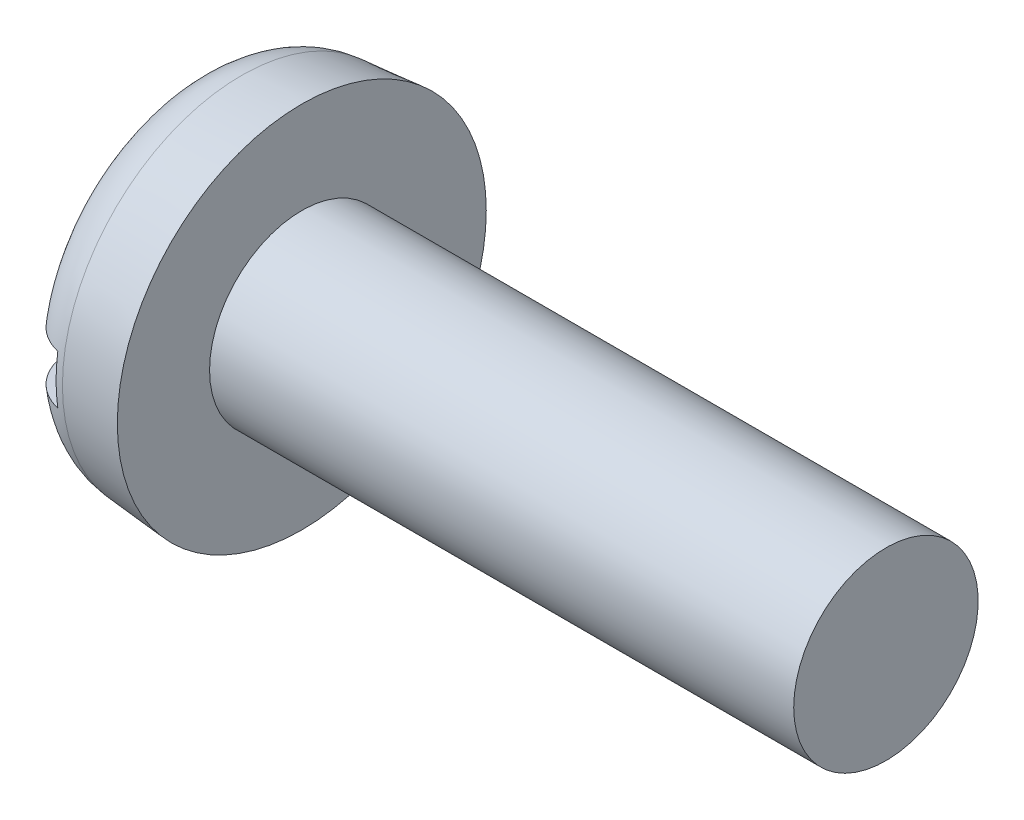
ISO-10303-21;
HEADER;
FILE_DESCRIPTION(('STEP AP214'),'2;1');
FILE_NAME('part.step','',(''),(''),'','','');
FILE_SCHEMA(('AUTOMOTIVE_DESIGN { 1 0 10303 214 1 1 1 1 }'));
ENDSEC;
DATA;
#1=APPLICATION_CONTEXT('core data for automotive mechanical design processes');
#2=APPLICATION_PROTOCOL_DEFINITION('international standard','automotive_design',2000,#1);
#3=PRODUCT_CONTEXT('',#1,'mechanical');
#4=PRODUCT('Part','Part','',(#3));
#5=PRODUCT_RELATED_PRODUCT_CATEGORY('part','',(#4));
#6=PRODUCT_DEFINITION_FORMATION('','',#4);
#7=PRODUCT_DEFINITION_CONTEXT('part definition',#1,'design');
#8=PRODUCT_DEFINITION('design','',#6,#7);
#9=PRODUCT_DEFINITION_SHAPE('','',#8);
#10=(LENGTH_UNIT() NAMED_UNIT(*) SI_UNIT(.MILLI.,.METRE.));
#11=(NAMED_UNIT(*) PLANE_ANGLE_UNIT() SI_UNIT($,.RADIAN.));
#12=(NAMED_UNIT(*) SI_UNIT($,.STERADIAN.) SOLID_ANGLE_UNIT());
#13=UNCERTAINTY_MEASURE_WITH_UNIT(LENGTH_MEASURE(1.E-05),#10,'distance_accuracy_value','');
#14=(GEOMETRIC_REPRESENTATION_CONTEXT(3) GLOBAL_UNCERTAINTY_ASSIGNED_CONTEXT((#13)) GLOBAL_UNIT_ASSIGNED_CONTEXT((#10,
#11,#12)) REPRESENTATION_CONTEXT('',''));
#15=CARTESIAN_POINT('',(0.,0.,0.));
#16=DIRECTION('',(0.,0.,1.));
#17=DIRECTION('',(1.,0.,0.));
#18=AXIS2_PLACEMENT_3D('',#15,#16,#17);
#19=CARTESIAN_POINT('',(0.,0.,0.));
#20=DIRECTION('',(-1.,0.,0.));
#21=DIRECTION('',(0.,0.,1.));
#22=AXIS2_PLACEMENT_3D('',#19,#20,#21);
#23=PLANE('',#22);
#24=DIRECTION('',(0.,0.,-1.));
#25=VECTOR('',#24,1.);
#26=CARTESIAN_POINT('',(0.,0.799999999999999,6.));
#27=LINE('',#26,#25);
#28=CARTESIAN_POINT('',(0.,0.799999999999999,3.9555566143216));
#29=VERTEX_POINT('',#28);
#30=CARTESIAN_POINT('',(0.,0.799999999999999,-3.9555566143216));
#31=VERTEX_POINT('',#30);
#32=EDGE_CURVE('E85',#29,#31,#27,.T.);
#33=ORIENTED_EDGE('',*,*,#32,.F.);
#34=CARTESIAN_POINT('',(0.,0.,0.));
#35=DIRECTION('',(-1.,0.,0.));
#36=DIRECTION('',(0.,0.,1.));
#37=AXIS2_PLACEMENT_3D('',#34,#35,#36);
#38=CIRCLE('',#37,4.03564469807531);
#39=EDGE_CURVE('E91',#29,#31,#38,.T.);
#40=ORIENTED_EDGE('',*,*,#39,.T.);
#41=EDGE_LOOP('',(#33,#40));
#42=FACE_BOUND('',#41,.T.);
#43=ADVANCED_FACE('F32',(#42),#23,.T.);
#44=CARTESIAN_POINT('',(-25.4,0.,0.));
#45=DIRECTION('',(-1.,0.,0.));
#46=DIRECTION('',(0.,0.,1.));
#47=AXIS2_PLACEMENT_3D('',#44,#45,#46);
#48=CYLINDRICAL_SURFACE('',#47,3.);
#49=CARTESIAN_POINT('',(22.6,0.,0.));
#50=DIRECTION('',(-1.,0.,0.));
#51=DIRECTION('',(0.,0.,1.));
#52=AXIS2_PLACEMENT_3D('',#49,#50,#51);
#53=CIRCLE('',#52,3.);
#54=CARTESIAN_POINT('',(22.6,0.,3.));
#55=VERTEX_POINT('',#54);
#56=EDGE_CURVE('E92',#55,#55,#53,.T.);
#57=ORIENTED_EDGE('',*,*,#56,.T.);
#58=EDGE_LOOP('',(#57));
#59=FACE_BOUND('',#58,.T.);
#60=CARTESIAN_POINT('',(3.6,0.,0.));
#61=DIRECTION('',(-1.,0.,0.));
#62=DIRECTION('',(0.,0.,1.));
#63=AXIS2_PLACEMENT_3D('',#60,#61,#62);
#64=CIRCLE('',#63,3.);
#65=CARTESIAN_POINT('',(3.6,0.,3.));
#66=VERTEX_POINT('',#65);
#67=EDGE_CURVE('E149',#66,#66,#64,.T.);
#68=ORIENTED_EDGE('',*,*,#67,.F.);
#69=EDGE_LOOP('',(#68));
#70=FACE_BOUND('',#69,.T.);
#71=ADVANCED_FACE('F137',(#59,#70),#48,.T.);
#72=CARTESIAN_POINT('',(22.6,3.,0.));
#73=DIRECTION('',(1.,0.,0.));
#74=DIRECTION('',(0.,0.,-1.));
#75=AXIS2_PLACEMENT_3D('',#72,#73,#74);
#76=PLANE('',#75);
#77=ORIENTED_EDGE('',*,*,#56,.F.);
#78=EDGE_LOOP('',(#77));
#79=FACE_BOUND('',#78,.T.);
#80=ADVANCED_FACE('F135',(#79),#76,.T.);
#81=DIRECTION('',(0.,0.,1.));
#82=VECTOR('',#81,1.);
#83=CARTESIAN_POINT('',(0.,-0.799999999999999,-6.));
#84=LINE('',#83,#82);
#85=CARTESIAN_POINT('',(0.,-0.799999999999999,-3.9555566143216));
#86=VERTEX_POINT('',#85);
#87=CARTESIAN_POINT('',(0.,-0.800000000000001,3.9555566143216));
#88=VERTEX_POINT('',#87);
#89=EDGE_CURVE('E76',#86,#88,#84,.T.);
#90=ORIENTED_EDGE('',*,*,#89,.F.);
#91=EDGE_CURVE('E83',#86,#88,#38,.T.);
#92=ORIENTED_EDGE('',*,*,#91,.T.);
#93=EDGE_LOOP('',(#90,#92));
#94=FACE_BOUND('',#93,.T.);
#95=ADVANCED_FACE('F82',(#94),#23,.T.);
#96=CARTESIAN_POINT('',(0.,0.,0.));
#97=DIRECTION('',(1.,0.,0.));
#98=DIRECTION('',(0.,0.,-1.));
#99=AXIS2_PLACEMENT_3D('',#96,#97,#98);
#100=CONICAL_SURFACE('',#99,5.68504081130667,0.0872664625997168);
#101=CARTESIAN_POINT('',(1.64311966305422,0.,0.));
#102=DIRECTION('',(-1.,0.,0.));
#103=DIRECTION('',(0.,0.,1.));
#104=AXIS2_PLACEMENT_3D('',#101,#102,#103);
#105=CIRCLE('',#104,5.82879515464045);
#106=CARTESIAN_POINT('',(1.64311966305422,0.,5.82879515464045));
#107=VERTEX_POINT('',#106);
#108=EDGE_CURVE('E95',#107,#107,#105,.F.);
#109=ORIENTED_EDGE('',*,*,#108,.T.);
#110=EDGE_LOOP('',(#109));
#111=FACE_BOUND('',#110,.T.);
#112=CARTESIAN_POINT('',(3.6,0.,0.));
#113=DIRECTION('',(-1.,0.,0.));
#114=DIRECTION('',(0.,0.,1.));
#115=AXIS2_PLACEMENT_3D('',#112,#113,#114);
#116=CIRCLE('',#115,6.);
#117=CARTESIAN_POINT('',(3.6,0.,6.));
#118=VERTEX_POINT('',#117);
#119=EDGE_CURVE('E97',#118,#118,#116,.T.);
#120=ORIENTED_EDGE('',*,*,#119,.T.);
#121=EDGE_LOOP('',(#120));
#122=FACE_BOUND('',#121,.T.);
#123=ADVANCED_FACE('F128',(#111,#122),#100,.T.);
#124=CARTESIAN_POINT('',(3.6,3.,0.));
#125=DIRECTION('',(-1.,0.,0.));
#126=DIRECTION('',(0.,0.,1.));
#127=AXIS2_PLACEMENT_3D('',#124,#125,#126);
#128=PLANE('',#127);
#129=ORIENTED_EDGE('',*,*,#119,.F.);
#130=EDGE_LOOP('',(#129));
#131=FACE_BOUND('',#130,.T.);
#132=ORIENTED_EDGE('',*,*,#67,.T.);
#133=EDGE_LOOP('',(#132));
#134=FACE_BOUND('',#133,.T.);
#135=ADVANCED_FACE('F124',(#131,#134),#128,.F.);
#136=CARTESIAN_POINT('',(1.8,0.,0.));
#137=DIRECTION('',(-1.,0.,0.));
#138=DIRECTION('',(0.,0.,1.));
#139=AXIS2_PLACEMENT_3D('',#136,#137,#138);
#140=TOROIDAL_SURFACE('',#139,4.03564469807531,1.8);
#141=CARTESIAN_POINT('',(0.540762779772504,0.799999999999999,-5.2613759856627));
#142=CARTESIAN_POINT('',(0.612348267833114,0.799999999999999,-5.33226007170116));
#143=CARTESIAN_POINT('',(0.689931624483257,0.799999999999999,-5.3971854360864));
#144=CARTESIAN_POINT('',(0.854947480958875,0.799999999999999,-5.51316161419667));
#145=CARTESIAN_POINT('',(0.94239068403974,0.799999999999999,-5.56419714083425));
#146=CARTESIAN_POINT('',(1.12461220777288,0.799999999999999,-5.650821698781));
#147=CARTESIAN_POINT('',(1.21938917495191,0.799999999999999,-5.6864135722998));
#148=CARTESIAN_POINT('',(1.41356630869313,0.799999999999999,-5.74109194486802));
#149=CARTESIAN_POINT('',(1.51296538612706,0.799999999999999,-5.76018231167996));
#150=CARTESIAN_POINT('',(1.71313899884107,0.799999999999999,-5.78126121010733));
#151=CARTESIAN_POINT('',(1.81390602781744,0.799999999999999,-5.78332104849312));
#152=CARTESIAN_POINT('',(2.01435310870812,0.799999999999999,-5.77046455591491));
#153=CARTESIAN_POINT('',(2.11403314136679,0.799999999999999,-5.75554792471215));
#154=CARTESIAN_POINT('',(2.309314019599,0.799999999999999,-5.70921606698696));
#155=CARTESIAN_POINT('',(2.40492104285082,0.799999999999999,-5.67782686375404));
#156=CARTESIAN_POINT('',(2.58952927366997,0.799999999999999,-5.59948776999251));
#157=CARTESIAN_POINT('',(2.67853045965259,0.799999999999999,-5.55253782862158));
#158=CARTESIAN_POINT('',(2.84769451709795,0.799999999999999,-5.44428887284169));
#159=CARTESIAN_POINT('',(2.92783091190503,0.799999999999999,-5.38294849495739));
#160=CARTESIAN_POINT('',(3.07676159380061,0.799999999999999,-5.24777626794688));
#161=CARTESIAN_POINT('',(3.1455556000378,0.799999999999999,-5.17394410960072));
#162=CARTESIAN_POINT('',(3.27042510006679,0.799999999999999,-5.01531035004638));
#163=CARTESIAN_POINT('',(3.32640120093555,0.799999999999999,-4.93043053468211));
#164=CARTESIAN_POINT('',(3.4235057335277,0.799999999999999,-4.75256933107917));
#165=CARTESIAN_POINT('',(3.46463341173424,0.799999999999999,-4.65958753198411));
#166=CARTESIAN_POINT('',(3.53144158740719,0.799999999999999,-4.46694835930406));
#167=CARTESIAN_POINT('',(3.55692557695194,0.799999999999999,-4.36722286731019));
#168=CARTESIAN_POINT('',(3.59108701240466,0.799999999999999,-4.16493761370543));
#169=CARTESIAN_POINT('',(3.59976314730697,0.799999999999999,-4.06237763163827));
#170=CARTESIAN_POINT('',(3.60023112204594,0.799999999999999,-3.85550711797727));
#171=CARTESIAN_POINT('',(3.59173848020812,0.799999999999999,-3.75119596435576));
#172=CARTESIAN_POINT('',(3.55768438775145,0.799999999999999,-3.54539907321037));
#173=CARTESIAN_POINT('',(3.53212117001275,0.799999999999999,-3.44391362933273));
#174=CARTESIAN_POINT('',(3.46412322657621,0.799999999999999,-3.24471369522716));
#175=CARTESIAN_POINT('',(3.42139292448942,0.799999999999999,-3.14710004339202));
#176=CARTESIAN_POINT('',(3.32030286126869,0.799999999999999,-2.96031799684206));
#177=CARTESIAN_POINT('',(3.26194098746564,0.799999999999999,-2.87115074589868));
#178=CARTESIAN_POINT('',(3.13053846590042,0.799999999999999,-2.70303664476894));
#179=CARTESIAN_POINT('',(3.05736818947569,0.799999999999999,-2.62419095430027));
#180=CARTESIAN_POINT('',(2.89859048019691,0.799999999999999,-2.48017518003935));
#181=CARTESIAN_POINT('',(2.81298317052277,0.799999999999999,-2.41500496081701));
#182=CARTESIAN_POINT('',(2.6334271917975,0.799999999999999,-2.30187272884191));
#183=CARTESIAN_POINT('',(2.53967929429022,0.799999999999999,-2.25359299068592));
#184=CARTESIAN_POINT('',(2.34507363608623,0.799999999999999,-2.17455467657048));
#185=CARTESIAN_POINT('',(2.24421969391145,0.799999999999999,-2.14378676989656));
#186=CARTESIAN_POINT('',(2.04443930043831,0.799999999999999,-2.10254396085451));
#187=CARTESIAN_POINT('',(1.94573097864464,0.799999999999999,-2.09101175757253));
#188=CARTESIAN_POINT('',(1.74783816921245,0.799999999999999,-2.08550669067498));
#189=CARTESIAN_POINT('',(1.64865381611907,0.799999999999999,-2.09152912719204));
#190=CARTESIAN_POINT('',(1.45702700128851,0.799999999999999,-2.12018138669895));
#191=CARTESIAN_POINT('',(1.36447664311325,0.799999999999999,-2.14209986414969));
#192=CARTESIAN_POINT('',(1.18420660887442,0.799999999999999,-2.20075771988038));
#193=CARTESIAN_POINT('',(1.09648771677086,0.799999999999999,-2.23749949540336));
#194=CARTESIAN_POINT('',(0.925723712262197,0.799999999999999,-2.32557805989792));
#195=CARTESIAN_POINT('',(0.842868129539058,0.799999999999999,-2.37728131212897));
#196=CARTESIAN_POINT('',(0.686362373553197,0.799999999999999,-2.493116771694));
#197=CARTESIAN_POINT('',(0.612714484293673,0.799999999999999,-2.55725205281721));
#198=CARTESIAN_POINT('',(0.472161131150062,0.799999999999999,-2.70027682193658));
#199=CARTESIAN_POINT('',(0.405916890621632,0.799999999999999,-2.77981681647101));
#200=CARTESIAN_POINT('',(0.287173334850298,0.799999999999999,-2.9485732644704));
#201=CARTESIAN_POINT('',(0.234676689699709,0.799999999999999,-3.03779159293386));
#202=CARTESIAN_POINT('',(0.143214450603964,0.799999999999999,-3.22677844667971));
#203=CARTESIAN_POINT('',(0.104782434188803,0.799999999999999,-3.32680584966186));
#204=CARTESIAN_POINT('',(0.0452446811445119,0.799999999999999,-3.5318922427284));
#205=CARTESIAN_POINT('',(0.0241387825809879,0.799999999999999,-3.63695118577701));
#206=CARTESIAN_POINT('',(-1.12670491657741E-05,0.799999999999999,-3.84916824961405));
#207=CARTESIAN_POINT('',(-0.00304965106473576,0.799999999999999,-3.95632702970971));
#208=CARTESIAN_POINT('',(0.00921984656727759,0.799999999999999,-4.16962319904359));
#209=CARTESIAN_POINT('',(0.0245310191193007,0.799999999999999,-4.27576040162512));
#210=CARTESIAN_POINT('',(0.0728327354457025,0.799999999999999,-4.48216521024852));
#211=CARTESIAN_POINT('',(0.105541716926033,0.799999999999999,-4.58249883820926));
#212=CARTESIAN_POINT('',(0.187634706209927,0.799999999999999,-4.77599767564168));
#213=CARTESIAN_POINT('',(0.236996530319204,0.799999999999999,-4.86917222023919));
#214=CARTESIAN_POINT('',(0.329466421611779,0.799999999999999,-5.01228034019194));
#215=CARTESIAN_POINT('',(0.367921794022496,0.799999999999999,-5.06527765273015));
#216=CARTESIAN_POINT('',(0.450329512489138,0.799999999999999,-5.16681267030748));
#217=CARTESIAN_POINT('',(0.494281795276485,0.799999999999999,-5.21535042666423));
#218=CARTESIAN_POINT('',(0.540762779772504,0.799999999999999,-5.2613759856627));
#219=B_SPLINE_CURVE_WITH_KNOTS('',3,(#141,#142,#143,#144,#145,#146,#147,#148,#149,#150,#151,
#152,#153,#154,#155,#156,#157,#158,#159,#160,#161,#162,#163,#164,#165,#166,#167,#168,#169,#170,
#171,#172,#173,#174,#175,#176,#177,#178,#179,#180,#181,#182,#183,#184,#185,#186,#187,#188,#189,
#190,#191,#192,#193,#194,#195,#196,#197,#198,#199,#200,#201,#202,#203,#204,#205,#206,#207,#208,
#209,#210,#211,#212,#213,#214,#215,#216,#217,#218),.UNSPECIFIED.,.T.,.F.,(4,2,2,2,2,2,2,2,2,2,2,
2,2,2,2,2,2,2,2,2,2,2,2,2,2,2,2,2,2,2,2,2,2,2,2,2,2,2,4),(0.,0.301990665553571,
0.604312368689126,0.906578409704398,1.20877358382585,1.50970282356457,1.81063738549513,
2.11109795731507,2.41155951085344,2.71289551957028,3.01423898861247,3.31784547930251,
3.6214673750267,3.92882908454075,4.23621476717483,4.54873547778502,4.86128854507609,
5.17947093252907,5.49769634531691,5.81883829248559,6.13997705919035,6.45470120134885,
6.76925749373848,7.06587349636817,7.36241009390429,7.64643650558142,7.93050886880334,
8.22223277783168,8.51402890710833,8.8231740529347,9.13237919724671,9.45232886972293,
9.77227555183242,10.0923243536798,10.4124305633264,10.7275071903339,11.042165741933,
11.2382527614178,11.4343375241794),.UNSPECIFIED.);
#220=CARTESIAN_POINT('',(1.4,0.799999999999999,-5.73510972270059));
#221=VERTEX_POINT('',#220);
#222=EDGE_CURVE('E11',#31,#221,#219,.T.);
#223=ORIENTED_EDGE('',*,*,#222,.F.);
#224=ORIENTED_EDGE('',*,*,#39,.F.);
#225=CARTESIAN_POINT('',(0.836266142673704,0.799999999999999,2.3847675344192));
#226=CARTESIAN_POINT('',(0.917616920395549,0.799999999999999,2.33037611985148));
#227=CARTESIAN_POINT('',(1.00338812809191,0.799999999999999,2.28250940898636));
#228=CARTESIAN_POINT('',(1.18171371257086,0.799999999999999,2.20157945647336));
#229=CARTESIAN_POINT('',(1.27427138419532,0.799999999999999,2.16852346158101));
#230=CARTESIAN_POINT('',(1.46387360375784,0.799999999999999,2.11861651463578));
#231=CARTESIAN_POINT('',(1.56092620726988,0.799999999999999,2.10179593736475));
#232=CARTESIAN_POINT('',(1.75645828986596,0.799999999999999,2.08531619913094));
#233=CARTESIAN_POINT('',(1.85493729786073,0.799999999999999,2.08565149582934));
#234=CARTESIAN_POINT('',(2.04724581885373,0.799999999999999,2.10316628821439));
#235=CARTESIAN_POINT('',(2.1411242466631,0.799999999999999,2.11981673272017));
#236=CARTESIAN_POINT('',(2.32483197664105,0.799999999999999,2.16840533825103));
#237=CARTESIAN_POINT('',(2.41466058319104,0.799999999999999,2.20034611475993));
#238=CARTESIAN_POINT('',(2.58937479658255,0.799999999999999,2.27883470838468));
#239=CARTESIAN_POINT('',(2.67416016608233,0.799999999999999,2.32560484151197));
#240=CARTESIAN_POINT('',(2.83527159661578,0.799999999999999,2.43194790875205));
#241=CARTESIAN_POINT('',(2.91159566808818,0.799999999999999,2.4915238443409));
#242=CARTESIAN_POINT('',(3.05833847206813,0.799999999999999,2.62557742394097));
#243=CARTESIAN_POINT('',(3.12814463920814,0.799999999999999,2.70072607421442));
#244=CARTESIAN_POINT('',(3.25476371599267,0.799999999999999,2.86127427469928));
#245=CARTESIAN_POINT('',(3.31157384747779,0.799999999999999,2.94667601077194));
#246=CARTESIAN_POINT('',(3.41282909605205,0.799999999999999,3.12914373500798));
#247=CARTESIAN_POINT('',(3.4566732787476,0.799999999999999,3.22654397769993));
#248=CARTESIAN_POINT('',(3.52749042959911,0.799999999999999,3.42730182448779));
#249=CARTESIAN_POINT('',(3.55446245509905,0.799999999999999,3.53065976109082));
#250=CARTESIAN_POINT('',(3.59074777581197,0.799999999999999,3.74099682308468));
#251=CARTESIAN_POINT('',(3.59996828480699,0.799999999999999,3.84799201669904));
#252=CARTESIAN_POINT('',(3.60003154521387,0.799999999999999,4.06199242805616));
#253=CARTESIAN_POINT('',(3.59087543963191,0.799999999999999,4.16899764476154));
#254=CARTESIAN_POINT('',(3.5545508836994,0.799999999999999,4.37828946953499));
#255=CARTESIAN_POINT('',(3.5276490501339,0.799999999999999,4.48062230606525));
#256=CARTESIAN_POINT('',(3.45672417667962,0.799999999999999,4.67917518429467));
#257=CARTESIAN_POINT('',(3.41270279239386,0.799999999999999,4.77539581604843));
#258=CARTESIAN_POINT('',(3.30967441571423,0.799999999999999,4.95711293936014));
#259=CARTESIAN_POINT('',(3.2509575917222,0.799999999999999,5.04277397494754));
#260=CARTESIAN_POINT('',(3.11977209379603,0.799999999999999,5.20282644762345));
#261=CARTESIAN_POINT('',(3.04730458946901,0.799999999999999,5.27721884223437));
#262=CARTESIAN_POINT('',(2.89186263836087,0.799999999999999,5.41145672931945));
#263=CARTESIAN_POINT('',(2.80906226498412,0.799999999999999,5.47150384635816));
#264=CARTESIAN_POINT('',(2.63447307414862,0.799999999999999,5.57667826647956));
#265=CARTESIAN_POINT('',(2.54268479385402,0.799999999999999,5.62180646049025));
#266=CARTESIAN_POINT('',(2.35372245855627,0.799999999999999,5.69541178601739));
#267=CARTESIAN_POINT('',(2.25661170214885,0.799999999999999,5.72405148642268));
#268=CARTESIAN_POINT('',(2.05894963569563,0.799999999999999,5.76452632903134));
#269=CARTESIAN_POINT('',(1.95839844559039,0.799999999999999,5.77636205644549));
#270=CARTESIAN_POINT('',(1.75726466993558,0.799999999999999,5.78286013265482));
#271=CARTESIAN_POINT('',(1.65668492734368,0.799999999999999,5.77761084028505));
#272=CARTESIAN_POINT('',(1.45783846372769,0.799999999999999,5.75028865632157));
#273=CARTESIAN_POINT('',(1.35957171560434,0.799999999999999,5.72821596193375));
#274=CARTESIAN_POINT('',(1.16819371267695,0.799999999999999,5.66791633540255));
#275=CARTESIAN_POINT('',(1.07507939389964,0.799999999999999,5.62969912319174));
#276=CARTESIAN_POINT('',(0.896555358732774,0.799999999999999,5.53823241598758));
#277=CARTESIAN_POINT('',(0.811145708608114,0.799999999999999,5.4849827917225));
#278=CARTESIAN_POINT('',(0.650082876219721,0.799999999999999,5.36476593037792));
#279=CARTESIAN_POINT('',(0.574468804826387,0.799999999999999,5.29774630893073));
#280=CARTESIAN_POINT('',(0.435451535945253,0.799999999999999,5.15205983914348));
#281=CARTESIAN_POINT('',(0.372048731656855,0.799999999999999,5.07339261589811));
#282=CARTESIAN_POINT('',(0.258650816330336,0.799999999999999,4.90594446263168));
#283=CARTESIAN_POINT('',(0.208774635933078,0.799999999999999,4.81708301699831));
#284=CARTESIAN_POINT('',(0.124428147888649,0.799999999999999,4.63233098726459));
#285=CARTESIAN_POINT('',(0.0899587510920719,0.799999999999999,4.53643998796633));
#286=CARTESIAN_POINT('',(0.0368868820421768,0.799999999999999,4.33899079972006));
#287=CARTESIAN_POINT('',(0.0185025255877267,0.799999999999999,4.23737401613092));
#288=CARTESIAN_POINT('',(-0.00125734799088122,0.799999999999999,4.03250747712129));
#289=CARTESIAN_POINT('',(-0.00263209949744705,0.799999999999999,3.9292576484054));
#290=CARTESIAN_POINT('',(0.0116307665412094,0.799999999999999,3.72214563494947));
#291=CARTESIAN_POINT('',(0.0275632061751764,0.799999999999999,3.61830377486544));
#292=CARTESIAN_POINT('',(0.0763335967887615,0.799999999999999,3.41464106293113));
#293=CARTESIAN_POINT('',(0.10917724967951,0.799999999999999,3.31482157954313));
#294=CARTESIAN_POINT('',(0.191511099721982,0.799999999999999,3.12021092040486));
#295=CARTESIAN_POINT('',(0.241286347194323,0.799999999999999,3.02554040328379));
#296=CARTESIAN_POINT('',(0.355915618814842,0.799999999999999,2.8458978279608));
#297=CARTESIAN_POINT('',(0.420755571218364,0.799999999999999,2.76091682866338));
#298=CARTESIAN_POINT('',(0.543269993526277,0.799999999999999,2.62572980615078));
#299=CARTESIAN_POINT('',(0.597683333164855,0.799999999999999,2.57253239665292));
#300=CARTESIAN_POINT('',(0.712598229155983,0.799999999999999,2.4731680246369));
#301=CARTESIAN_POINT('',(0.773099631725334,0.799999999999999,2.42700088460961));
#302=CARTESIAN_POINT('',(0.836266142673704,0.799999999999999,2.3847675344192));
#303=B_SPLINE_CURVE_WITH_KNOTS('',3,(#225,#226,#227,#228,#229,#230,#231,#232,#233,#234,#235,
#236,#237,#238,#239,#240,#241,#242,#243,#244,#245,#246,#247,#248,#249,#250,#251,#252,#253,#254,
#255,#256,#257,#258,#259,#260,#261,#262,#263,#264,#265,#266,#267,#268,#269,#270,#271,#272,#273,
#274,#275,#276,#277,#278,#279,#280,#281,#282,#283,#284,#285,#286,#287,#288,#289,#290,#291,#292,
#293,#294,#295,#296,#297,#298,#299,#300,#301,#302),.UNSPECIFIED.,.T.,.F.,(4,2,2,2,2,2,2,2,2,2,2,
2,2,2,2,2,2,2,2,2,2,2,2,2,2,2,2,2,2,2,2,2,2,2,2,2,2,2,4),(0.,0.293321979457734,
0.586787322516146,0.880800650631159,1.17471899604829,1.45941156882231,1.74415285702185,
2.03338255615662,2.32268012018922,2.62901646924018,2.93541824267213,3.25435495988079,
3.57330949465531,3.89392670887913,4.21452398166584,4.53041098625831,4.84626744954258,
5.1563211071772,5.46634840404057,5.77172128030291,6.0770759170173,6.37936593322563,
6.6816454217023,6.98236409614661,7.2830792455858,7.5836136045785,7.88415054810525,
8.18585270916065,8.48756458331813,8.79184901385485,9.09615143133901,9.40451898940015,
9.71290042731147,10.0266186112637,10.3404426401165,10.6598354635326,10.9789311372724,
11.2066928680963,11.43444884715),.UNSPECIFIED.);
#304=CARTESIAN_POINT('',(1.4,0.799999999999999,5.73510972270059));
#305=VERTEX_POINT('',#304);
#306=EDGE_CURVE('E109',#305,#29,#303,.T.);
#307=ORIENTED_EDGE('',*,*,#306,.F.);
#308=CARTESIAN_POINT('',(1.4,0.,0.));
#309=DIRECTION('',(-1.,0.,0.));
#310=DIRECTION('',(0.,0.,1.));
#311=AXIS2_PLACEMENT_3D('',#308,#309,#310);
#312=CIRCLE('',#311,5.79063757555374);
#313=CARTESIAN_POINT('',(1.4,-0.800000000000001,5.73510972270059));
#314=VERTEX_POINT('',#313);
#315=EDGE_CURVE('E103',#305,#314,#312,.F.);
#316=ORIENTED_EDGE('',*,*,#315,.T.);
#317=CARTESIAN_POINT('',(0.836266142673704,-0.8,2.3847675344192));
#318=CARTESIAN_POINT('',(0.748506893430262,-0.8,2.44345191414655));
#319=CARTESIAN_POINT('',(0.665766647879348,-0.8,2.50981960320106));
#320=CARTESIAN_POINT('',(0.512551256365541,-0.8,2.65561376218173));
#321=CARTESIAN_POINT('',(0.442099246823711,-0.8,2.73506432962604));
#322=CARTESIAN_POINT('',(0.315475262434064,-0.8,2.90443495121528));
#323=CARTESIAN_POINT('',(0.259280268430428,-0.8,2.99433778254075));
#324=CARTESIAN_POINT('',(0.162548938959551,-0.8,3.18215299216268));
#325=CARTESIAN_POINT('',(0.122006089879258,-0.8,3.28006201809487));
#326=CARTESIAN_POINT('',(0.0572425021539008,-0.8,3.4827212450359));
#327=CARTESIAN_POINT('',(0.0332676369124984,-0.8,3.58755021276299));
#328=CARTESIAN_POINT('',(0.00342578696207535,-0.8,3.79976969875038));
#329=CARTESIAN_POINT('',(-0.00244009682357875,-0.800000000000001,3.90716037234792));
#330=CARTESIAN_POINT('',(0.00425089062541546,-0.800000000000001,4.12040369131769));
#331=CARTESIAN_POINT('',(0.0166422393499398,-0.800000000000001,4.22626147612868));
#332=CARTESIAN_POINT('',(0.0593599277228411,-0.800000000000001,4.43429705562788));
#333=CARTESIAN_POINT('',(0.0896844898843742,-0.800000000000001,4.53647521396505));
#334=CARTESIAN_POINT('',(0.166811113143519,-0.800000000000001,4.73226366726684));
#335=CARTESIAN_POINT('',(0.21330327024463,-0.800000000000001,4.82599604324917));
#336=CARTESIAN_POINT('',(0.32162267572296,-0.800000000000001,5.00413844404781));
#337=CARTESIAN_POINT('',(0.383448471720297,-0.800000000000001,5.08854935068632));
#338=CARTESIAN_POINT('',(0.519544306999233,-0.800000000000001,5.24416143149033));
#339=CARTESIAN_POINT('',(0.593588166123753,-0.800000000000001,5.31556046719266));
#340=CARTESIAN_POINT('',(0.752739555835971,-0.800000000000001,5.44472836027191));
#341=CARTESIAN_POINT('',(0.837846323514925,-0.800000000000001,5.5024981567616));
#342=CARTESIAN_POINT('',(1.01558854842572,-0.800000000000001,5.60205300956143));
#343=CARTESIAN_POINT('',(1.10812041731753,-0.800000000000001,5.64402306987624));
#344=CARTESIAN_POINT('',(1.29895009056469,-0.800000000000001,5.71170590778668));
#345=CARTESIAN_POINT('',(1.39724763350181,-0.800000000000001,5.7374194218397));
#346=CARTESIAN_POINT('',(1.59606633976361,-0.800000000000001,5.77169733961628));
#347=CARTESIAN_POINT('',(1.69656671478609,-0.800000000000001,5.78038241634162));
#348=CARTESIAN_POINT('',(1.89759433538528,-0.800000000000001,5.78071120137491));
#349=CARTESIAN_POINT('',(1.99812158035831,-0.800000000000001,5.77235526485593));
#350=CARTESIAN_POINT('',(2.19609344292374,-0.800000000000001,5.73889133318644));
#351=CARTESIAN_POINT('',(2.29354498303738,-0.800000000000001,5.71382425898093));
#352=CARTESIAN_POINT('',(2.48286854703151,-0.800000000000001,5.64771711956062));
#353=CARTESIAN_POINT('',(2.57474056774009,-0.800000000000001,5.60667704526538));
#354=CARTESIAN_POINT('',(2.75051258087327,-0.800000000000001,5.50972539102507));
#355=CARTESIAN_POINT('',(2.8343959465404,-0.800000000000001,5.45378367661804));
#356=CARTESIAN_POINT('',(2.99165678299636,-0.800000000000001,5.32869697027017));
#357=CARTESIAN_POINT('',(3.06503402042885,-0.800000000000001,5.25955168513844));
#358=CARTESIAN_POINT('',(3.19973989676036,-0.800000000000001,5.10955333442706));
#359=CARTESIAN_POINT('',(3.26098586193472,-0.800000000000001,5.02862604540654));
#360=CARTESIAN_POINT('',(3.36919753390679,-0.800000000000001,4.85773374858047));
#361=CARTESIAN_POINT('',(3.41616259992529,-0.800000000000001,4.76776833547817));
#362=CARTESIAN_POINT('',(3.49507738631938,-0.800000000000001,4.5802716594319));
#363=CARTESIAN_POINT('',(3.52685014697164,-0.800000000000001,4.48266594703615));
#364=CARTESIAN_POINT('',(3.57383908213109,-0.800000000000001,4.28355151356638));
#365=CARTESIAN_POINT('',(3.58905405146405,-0.800000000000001,4.18204250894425));
#366=CARTESIAN_POINT('',(3.60277332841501,-0.800000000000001,3.97627512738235));
#367=CARTESIAN_POINT('',(3.60100695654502,-0.8,3.87199872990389));
#368=CARTESIAN_POINT('',(3.58032198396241,-0.8,3.66516328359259));
#369=CARTESIAN_POINT('',(3.56140169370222,-0.8,3.56260440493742));
#370=CARTESIAN_POINT('',(3.50655445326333,-0.8,3.3601262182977));
#371=CARTESIAN_POINT('',(3.47032341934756,-0.8,3.26028924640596));
#372=CARTESIAN_POINT('',(3.38182060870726,-0.8,3.06798854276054));
#373=CARTESIAN_POINT('',(3.32954675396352,-0.8,2.97552576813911));
#374=CARTESIAN_POINT('',(3.20964725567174,-0.8,2.79948120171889));
#375=CARTESIAN_POINT('',(3.14184223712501,-0.8,2.71602141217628));
#376=CARTESIAN_POINT('',(2.99302219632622,-0.8,2.56181483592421));
#377=CARTESIAN_POINT('',(2.91200632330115,-0.8,2.49106886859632));
#378=CARTESIAN_POINT('',(2.73997760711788,-0.8,2.36551639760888));
#379=CARTESIAN_POINT('',(2.64910309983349,-0.8,2.31052086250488));
#380=CARTESIAN_POINT('',(2.4590409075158,-0.8,2.21753014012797));
#381=CARTESIAN_POINT('',(2.35985743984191,-0.8,2.17952638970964));
#382=CARTESIAN_POINT('',(2.16147923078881,-0.8,2.12383562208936));
#383=CARTESIAN_POINT('',(2.06255196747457,-0.8,2.10519696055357));
#384=CARTESIAN_POINT('',(1.86294330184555,-0.8,2.08580594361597));
#385=CARTESIAN_POINT('',(1.76226208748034,-0.8,2.08505168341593));
#386=CARTESIAN_POINT('',(1.56749167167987,-0.8,2.1010369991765));
#387=CARTESIAN_POINT('',(1.47332742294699,-0.8,2.11688981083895));
#388=CARTESIAN_POINT('',(1.28901868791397,-0.8,2.16397488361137));
#389=CARTESIAN_POINT('',(1.19886974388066,-0.8,2.19518960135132));
#390=CARTESIAN_POINT('',(1.0638315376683,-0.8,2.25452352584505));
#391=CARTESIAN_POINT('',(1.01673933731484,-0.8,2.27777851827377));
#392=CARTESIAN_POINT('',(0.924773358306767,-0.8,2.32831196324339));
#393=CARTESIAN_POINT('',(0.879899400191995,-0.8,2.35559008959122));
#394=CARTESIAN_POINT('',(0.836266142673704,-0.8,2.3847675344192));
#395=B_SPLINE_CURVE_WITH_KNOTS('',3,(#317,#318,#319,#320,#321,#322,#323,#324,#325,#326,#327,
#328,#329,#330,#331,#332,#333,#334,#335,#336,#337,#338,#339,#340,#341,#342,#343,#344,#345,#346,
#347,#348,#349,#350,#351,#352,#353,#354,#355,#356,#357,#358,#359,#360,#361,#362,#363,#364,#365,
#366,#367,#368,#369,#370,#371,#372,#373,#374,#375,#376,#377,#378,#379,#380,#381,#382,#383,#384,
#385,#386,#387,#388,#389,#390,#391,#392,#393,#394),.UNSPECIFIED.,.T.,.F.,(4,2,2,2,2,2,2,2,2,2,2,
2,2,2,2,2,2,2,2,2,2,2,2,2,2,2,2,2,2,2,2,2,2,2,2,2,2,2,4),(0.,0.316518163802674,
0.633625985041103,0.950218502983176,1.2666791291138,1.58774070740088,1.90882180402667,
2.22700979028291,2.54516624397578,2.8575328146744,3.16986980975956,3.47696670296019,
3.78404242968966,4.08740155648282,4.39074693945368,4.69193476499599,4.99311631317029,
5.29356304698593,5.59400995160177,5.89506910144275,6.19613493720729,6.49918680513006,
6.80225226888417,7.10876667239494,7.41530338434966,7.72673423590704,8.03819576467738,
8.35534173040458,8.6725287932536,8.99358246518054,9.31465682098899,9.63169865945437,
9.94858054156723,10.2490245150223,10.549436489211,10.8345871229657,11.1194128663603,
11.276796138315,11.4341666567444),.UNSPECIFIED.);
#396=EDGE_CURVE('E90',#88,#314,#395,.T.);
#397=ORIENTED_EDGE('',*,*,#396,.F.);
#398=ORIENTED_EDGE('',*,*,#91,.F.);
#399=CARTESIAN_POINT('',(0.540762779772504,-0.799999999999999,-5.2613759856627));
#400=CARTESIAN_POINT('',(0.46800256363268,-0.799999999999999,-5.18931554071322));
#401=CARTESIAN_POINT('',(0.401331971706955,-0.799999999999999,-5.11098969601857));
#402=CARTESIAN_POINT('',(0.282092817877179,-0.799999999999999,-4.94415021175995));
#403=CARTESIAN_POINT('',(0.229543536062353,-0.799999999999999,-4.85562287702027));
#404=CARTESIAN_POINT('',(0.140058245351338,-0.799999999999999,-4.67111833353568));
#405=CARTESIAN_POINT('',(0.103104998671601,-0.799999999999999,-4.57514948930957));
#406=CARTESIAN_POINT('',(0.0456444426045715,-0.799999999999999,-4.37844736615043));
#407=CARTESIAN_POINT('',(0.0251330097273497,-0.799999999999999,-4.27771528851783));
#408=CARTESIAN_POINT('',(0.000807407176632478,-0.799999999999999,-4.07306902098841));
#409=CARTESIAN_POINT('',(-0.00280970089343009,-0.799999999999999,-3.96913144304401));
#410=CARTESIAN_POINT('',(0.00712688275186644,-0.799999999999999,-3.76207815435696));
#411=CARTESIAN_POINT('',(0.0206829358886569,-0.8,-3.65896255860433));
#412=CARTESIAN_POINT('',(0.0648595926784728,-0.8,-3.45448287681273));
#413=CARTESIAN_POINT('',(0.0957869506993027,-0.8,-3.35318504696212));
#414=CARTESIAN_POINT('',(0.173966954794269,-0.8,-3.15709227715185));
#415=CARTESIAN_POINT('',(0.221221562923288,-0.8,-3.06229812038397));
#416=CARTESIAN_POINT('',(0.331523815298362,-0.8,-2.8805427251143));
#417=CARTESIAN_POINT('',(0.394784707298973,-0.8,-2.79371074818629));
#418=CARTESIAN_POINT('',(0.535080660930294,-0.8,-2.63196239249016));
#419=CARTESIAN_POINT('',(0.612117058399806,-0.8,-2.5570471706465));
#420=CARTESIAN_POINT('',(0.777363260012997,-0.8,-2.42207446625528));
#421=CARTESIAN_POINT('',(0.865488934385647,-0.8,-2.36191424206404));
#422=CARTESIAN_POINT('',(1.05097305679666,-0.8,-2.25807126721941));
#423=CARTESIAN_POINT('',(1.1483280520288,-0.8,-2.21438238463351));
#424=CARTESIAN_POINT('',(1.34472607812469,-0.8,-2.14709500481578));
#425=CARTESIAN_POINT('',(1.44348146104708,-0.8,-2.12265879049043));
#426=CARTESIAN_POINT('',(1.64375523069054,-0.8,-2.09184121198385));
#427=CARTESIAN_POINT('',(1.74527230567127,-0.8,-2.08545142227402));
#428=CARTESIAN_POINT('',(1.94205144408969,-0.8,-2.09089422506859));
#429=CARTESIAN_POINT('',(2.03734311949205,-0.8,-2.1017185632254));
#430=CARTESIAN_POINT('',(2.22475371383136,-0.8,-2.1391955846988));
#431=CARTESIAN_POINT('',(2.31687240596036,-0.8,-2.16584939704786));
#432=CARTESIAN_POINT('',(2.49568716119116,-0.8,-2.23389898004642));
#433=CARTESIAN_POINT('',(2.58237134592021,-0.8,-2.27532580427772));
#434=CARTESIAN_POINT('',(2.74807422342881,-0.8,-2.37138684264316));
#435=CARTESIAN_POINT('',(2.82709115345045,-0.8,-2.42602408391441));
#436=CARTESIAN_POINT('',(2.9799165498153,-0.8,-2.55022645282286));
#437=CARTESIAN_POINT('',(3.05318434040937,-0.8,-2.6204569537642));
#438=CARTESIAN_POINT('',(3.18755425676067,-0.8,-2.77172635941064));
#439=CARTESIAN_POINT('',(3.24865355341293,-0.8,-2.85276777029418));
#440=CARTESIAN_POINT('',(3.35979277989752,-0.8,-3.02754470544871));
#441=CARTESIAN_POINT('',(3.40917690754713,-0.8,-3.1216981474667));
#442=CARTESIAN_POINT('',(3.49164209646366,-0.8,-3.31689856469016));
#443=CARTESIAN_POINT('',(3.52472176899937,-0.8,-3.41794612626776));
#444=CARTESIAN_POINT('',(3.57383047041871,-0.8,-3.62528781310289));
#445=CARTESIAN_POINT('',(3.58966846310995,-0.8,-3.73162733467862));
#446=CARTESIAN_POINT('',(3.60302482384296,-0.8,-3.94545563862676));
#447=CARTESIAN_POINT('',(3.60054405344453,-0.799999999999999,-4.05294436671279));
#448=CARTESIAN_POINT('',(3.57730809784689,-0.799999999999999,-4.26456838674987));
#449=CARTESIAN_POINT('',(3.5567824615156,-0.799999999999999,-4.36872882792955));
#450=CARTESIAN_POINT('',(3.49820144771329,-0.799999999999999,-4.57200098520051));
#451=CARTESIAN_POINT('',(3.46014775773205,-0.799999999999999,-4.67111318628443));
#452=CARTESIAN_POINT('',(3.36835841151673,-0.799999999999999,-4.85952398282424));
#453=CARTESIAN_POINT('',(3.31492535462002,-0.799999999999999,-4.94897001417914));
#454=CARTESIAN_POINT('',(3.19357222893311,-0.799999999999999,-5.1174283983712));
#455=CARTESIAN_POINT('',(3.12565341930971,-0.799999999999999,-5.196441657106));
#456=CARTESIAN_POINT('',(2.97843308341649,-0.799999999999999,-5.34047951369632));
#457=CARTESIAN_POINT('',(2.89932889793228,-0.799999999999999,-5.40570586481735));
#458=CARTESIAN_POINT('',(2.73119091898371,-0.799999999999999,-5.52177624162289));
#459=CARTESIAN_POINT('',(2.64215774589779,-0.799999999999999,-5.57262116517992));
#460=CARTESIAN_POINT('',(2.45774484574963,-0.799999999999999,-5.65792437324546));
#461=CARTESIAN_POINT('',(2.36244515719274,-0.799999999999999,-5.69255575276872));
#462=CARTESIAN_POINT('',(2.16736859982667,-0.799999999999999,-5.7452167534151));
#463=CARTESIAN_POINT('',(2.06759209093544,-0.799999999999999,-5.76324770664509));
#464=CARTESIAN_POINT('',(1.8670464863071,-0.799999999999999,-5.78211504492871));
#465=CARTESIAN_POINT('',(1.76628722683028,-0.799999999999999,-5.78305617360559));
#466=CARTESIAN_POINT('',(1.56601778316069,-0.799999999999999,-5.76798048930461));
#467=CARTESIAN_POINT('',(1.46650790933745,-0.799999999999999,-5.75195954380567));
#468=CARTESIAN_POINT('',(1.27169371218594,-0.799999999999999,-5.70345798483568));
#469=CARTESIAN_POINT('',(1.17638560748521,-0.799999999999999,-5.67099251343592));
#470=CARTESIAN_POINT('',(0.992639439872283,-0.799999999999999,-5.59058259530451));
#471=CARTESIAN_POINT('',(0.904192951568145,-0.799999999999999,-5.54265751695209));
#472=CARTESIAN_POINT('',(0.770167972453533,-0.799999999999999,-5.45480755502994));
#473=CARTESIAN_POINT('',(0.72159797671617,-0.799999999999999,-5.41935523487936));
#474=CARTESIAN_POINT('',(0.628240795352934,-0.799999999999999,-5.34377955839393));
#475=CARTESIAN_POINT('',(0.583453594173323,-0.799999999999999,-5.30365622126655));
#476=CARTESIAN_POINT('',(0.540762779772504,-0.799999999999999,-5.2613759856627));
#477=B_SPLINE_CURVE_WITH_KNOTS('',3,(#399,#400,#401,#402,#403,#404,#405,#406,#407,#408,#409,
#410,#411,#412,#413,#414,#415,#416,#417,#418,#419,#420,#421,#422,#423,#424,#425,#426,#427,#428,
#429,#430,#431,#432,#433,#434,#435,#436,#437,#438,#439,#440,#441,#442,#443,#444,#445,#446,#447,
#448,#449,#450,#451,#452,#453,#454,#455,#456,#457,#458,#459,#460,#461,#462,#463,#464,#465,#466,
#467,#468,#469,#470,#471,#472,#473,#474,#475,#476),.UNSPECIFIED.,.T.,.F.,(4,2,2,2,2,2,2,2,2,2,2,
2,2,2,2,2,2,2,2,2,2,2,2,2,2,2,2,2,2,2,2,2,2,2,2,2,2,2,4),(0.,0.306991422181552,0.61439988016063,
0.921467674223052,1.22845843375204,1.53902124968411,1.84962677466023,2.1658978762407,
2.48220699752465,2.80297521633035,3.12377455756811,3.4422723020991,3.76065135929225,
4.06426589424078,4.36773865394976,4.65408102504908,4.94044382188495,5.22741215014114,
5.51444629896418,5.81757894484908,6.12078198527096,6.43825439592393,6.75575384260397,
7.07673643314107,7.39770392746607,7.71464653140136,8.03155862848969,8.34261788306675,
8.65365010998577,8.95975564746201,9.2658420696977,9.56858170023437,9.87129703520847,
10.1721563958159,10.4730890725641,10.7737451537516,11.0740260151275,11.254148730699,
11.4342707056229),.UNSPECIFIED.);
#478=CARTESIAN_POINT('',(1.4,-0.799999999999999,-5.73510972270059));
#479=VERTEX_POINT('',#478);
#480=EDGE_CURVE('E44',#479,#86,#477,.T.);
#481=ORIENTED_EDGE('',*,*,#480,.F.);
#482=EDGE_CURVE('E56',#479,#221,#312,.F.);
#483=ORIENTED_EDGE('',*,*,#482,.T.);
#484=EDGE_LOOP('',(#223,#224,#307,#316,#397,#398,#481,#483));
#485=FACE_BOUND('',#484,.T.);
#486=ORIENTED_EDGE('',*,*,#108,.F.);
#487=EDGE_LOOP('',(#486));
#488=FACE_BOUND('',#487,.T.);
#489=ADVANCED_FACE('F34',(#485,#488),#140,.T.);
#490=CARTESIAN_POINT('',(1.4,0.799999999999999,6.));
#491=DIRECTION('',(0.,1.,0.));
#492=DIRECTION('',(0.,0.,1.));
#493=AXIS2_PLACEMENT_3D('',#490,#491,#492);
#494=PLANE('',#493);
#495=ORIENTED_EDGE('',*,*,#222,.T.);
#496=DIRECTION('',(0.,0.,-1.));
#497=VECTOR('',#496,1.);
#498=CARTESIAN_POINT('',(1.4,0.799999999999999,6.));
#499=LINE('',#498,#497);
#500=EDGE_CURVE('E84',#305,#221,#499,.T.);
#501=ORIENTED_EDGE('',*,*,#500,.F.);
#502=ORIENTED_EDGE('',*,*,#306,.T.);
#503=ORIENTED_EDGE('',*,*,#32,.T.);
#504=EDGE_LOOP('',(#495,#501,#502,#503));
#505=FACE_BOUND('',#504,.T.);
#506=ADVANCED_FACE('F116',(#505),#494,.F.);
#507=CARTESIAN_POINT('',(1.4,-0.799999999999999,-6.));
#508=DIRECTION('',(0.,-1.,0.));
#509=DIRECTION('',(0.,0.,-1.));
#510=AXIS2_PLACEMENT_3D('',#507,#508,#509);
#511=PLANE('',#510);
#512=ORIENTED_EDGE('',*,*,#480,.T.);
#513=ORIENTED_EDGE('',*,*,#89,.T.);
#514=ORIENTED_EDGE('',*,*,#396,.T.);
#515=DIRECTION('',(0.,0.,1.));
#516=VECTOR('',#515,1.);
#517=CARTESIAN_POINT('',(1.4,-0.799999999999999,-6.));
#518=LINE('',#517,#516);
#519=EDGE_CURVE('E51',#479,#314,#518,.T.);
#520=ORIENTED_EDGE('',*,*,#519,.F.);
#521=EDGE_LOOP('',(#512,#513,#514,#520));
#522=FACE_BOUND('',#521,.T.);
#523=ADVANCED_FACE('F75',(#522),#511,.F.);
#524=CARTESIAN_POINT('',(1.4,0.799999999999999,-6.));
#525=DIRECTION('',(-1.,0.,0.));
#526=DIRECTION('',(0.,0.,1.));
#527=AXIS2_PLACEMENT_3D('',#524,#525,#526);
#528=PLANE('',#527);
#529=ORIENTED_EDGE('',*,*,#519,.T.);
#530=ORIENTED_EDGE('',*,*,#315,.F.);
#531=ORIENTED_EDGE('',*,*,#500,.T.);
#532=ORIENTED_EDGE('',*,*,#482,.F.);
#533=EDGE_LOOP('',(#529,#530,#531,#532));
#534=FACE_BOUND('',#533,.T.);
#535=ADVANCED_FACE('F115',(#534),#528,.T.);
#536=CLOSED_SHELL('',(#43,#71,#80,#95,#123,#135,#489,#506,#523,#535));
#537=MANIFOLD_SOLID_BREP('B2',#536);
#538=ADVANCED_BREP_SHAPE_REPRESENTATION('',(#18,#537),#14);
#539=SHAPE_DEFINITION_REPRESENTATION(#9,#538);
ENDSEC;
END-ISO-10303-21;
